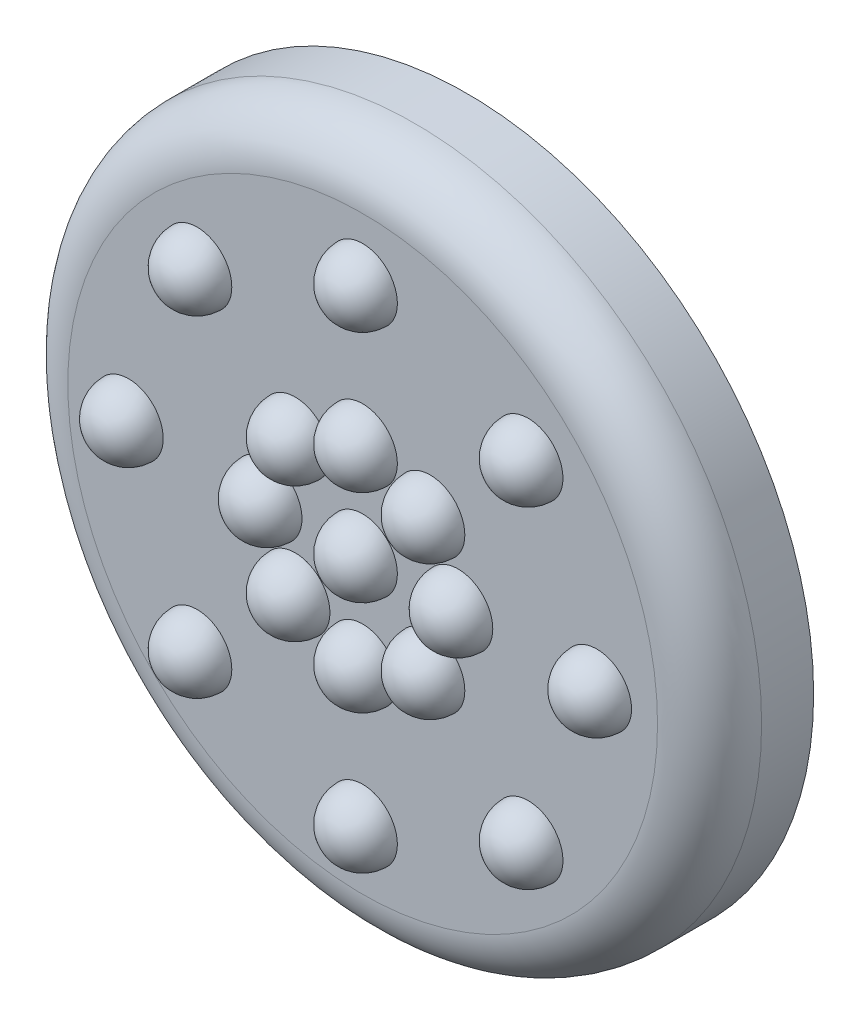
ISO-10303-21;
HEADER;
FILE_DESCRIPTION(('STEP AP214'),'2;1');
FILE_NAME('part.step','',(''),(''),'','','');
FILE_SCHEMA(('AUTOMOTIVE_DESIGN { 1 0 10303 214 1 1 1 1 }'));
ENDSEC;
DATA;
#1=APPLICATION_CONTEXT('core data for automotive mechanical design processes');
#2=APPLICATION_PROTOCOL_DEFINITION('international standard','automotive_design',2000,#1);
#3=PRODUCT_CONTEXT('',#1,'mechanical');
#4=PRODUCT('Part','Part','',(#3));
#5=PRODUCT_RELATED_PRODUCT_CATEGORY('part','',(#4));
#6=PRODUCT_DEFINITION_FORMATION('','',#4);
#7=PRODUCT_DEFINITION_CONTEXT('part definition',#1,'design');
#8=PRODUCT_DEFINITION('design','',#6,#7);
#9=PRODUCT_DEFINITION_SHAPE('','',#8);
#10=(LENGTH_UNIT() NAMED_UNIT(*) SI_UNIT(.MILLI.,.METRE.));
#11=(NAMED_UNIT(*) PLANE_ANGLE_UNIT() SI_UNIT($,.RADIAN.));
#12=(NAMED_UNIT(*) SI_UNIT($,.STERADIAN.) SOLID_ANGLE_UNIT());
#13=UNCERTAINTY_MEASURE_WITH_UNIT(LENGTH_MEASURE(1.E-05),#10,'distance_accuracy_value','');
#14=(GEOMETRIC_REPRESENTATION_CONTEXT(3) GLOBAL_UNCERTAINTY_ASSIGNED_CONTEXT((#13)) GLOBAL_UNIT_ASSIGNED_CONTEXT((#10,
#11,#12)) REPRESENTATION_CONTEXT('',''));
#15=CARTESIAN_POINT('',(0.,0.,0.));
#16=DIRECTION('',(0.,0.,1.));
#17=DIRECTION('',(1.,0.,0.));
#18=AXIS2_PLACEMENT_3D('',#15,#16,#17);
#19=CARTESIAN_POINT('',(0.,0.,30.));
#20=DIRECTION('',(0.,0.,-1.));
#21=DIRECTION('',(-1.,0.,0.));
#22=AXIS2_PLACEMENT_3D('',#19,#20,#21);
#23=CYLINDRICAL_SURFACE('',#22,100.);
#24=CARTESIAN_POINT('',(0.,0.,15.));
#25=DIRECTION('',(0.,0.,1.));
#26=DIRECTION('',(1.,0.,0.));
#27=AXIS2_PLACEMENT_3D('',#24,#25,#26);
#28=CIRCLE('',#27,100.);
#29=CARTESIAN_POINT('',(100.,0.,15.));
#30=VERTEX_POINT('',#29);
#31=EDGE_CURVE('E89',#30,#30,#28,.F.);
#32=ORIENTED_EDGE('',*,*,#31,.T.);
#33=EDGE_LOOP('',(#32));
#34=FACE_BOUND('',#33,.T.);
#35=CARTESIAN_POINT('',(0.,0.,0.));
#36=DIRECTION('',(0.,0.,1.));
#37=DIRECTION('',(1.,0.,0.));
#38=AXIS2_PLACEMENT_3D('',#35,#36,#37);
#39=CIRCLE('',#38,100.);
#40=CARTESIAN_POINT('',(100.,0.,0.));
#41=VERTEX_POINT('',#40);
#42=EDGE_CURVE('E95',#41,#41,#39,.T.);
#43=ORIENTED_EDGE('',*,*,#42,.T.);
#44=EDGE_LOOP('',(#43));
#45=FACE_BOUND('',#44,.T.);
#46=ADVANCED_FACE('F33',(#34,#45),#23,.T.);
#47=CARTESIAN_POINT('',(0.,0.,30.));
#48=DIRECTION('',(0.,0.,1.));
#49=DIRECTION('',(1.,0.,0.));
#50=AXIS2_PLACEMENT_3D('',#47,#48,#49);
#51=PLANE('',#50);
#52=CARTESIAN_POINT('',(0.,0.,30.));
#53=DIRECTION('',(0.,0.,1.));
#54=DIRECTION('',(1.,0.,0.));
#55=AXIS2_PLACEMENT_3D('',#52,#53,#54);
#56=CIRCLE('',#55,10.);
#57=CARTESIAN_POINT('',(10.,0.,30.));
#58=VERTEX_POINT('',#57);
#59=EDGE_CURVE('E37',#58,#58,#56,.F.);
#60=ORIENTED_EDGE('',*,*,#59,.T.);
#61=EDGE_LOOP('',(#60));
#62=FACE_BOUND('',#61,.T.);
#63=CARTESIAN_POINT('',(19.4454364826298,-19.4454364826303,30.));
#64=DIRECTION('',(0.,0.,1.));
#65=DIRECTION('',(1.,0.,0.));
#66=AXIS2_PLACEMENT_3D('',#63,#64,#65);
#67=CIRCLE('',#66,10.);
#68=CARTESIAN_POINT('',(29.4454364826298,-19.4454364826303,30.));
#69=VERTEX_POINT('',#68);
#70=EDGE_CURVE('E10',#69,#69,#67,.T.);
#71=ORIENTED_EDGE('',*,*,#70,.F.);
#72=EDGE_LOOP('',(#71));
#73=FACE_BOUND('',#72,.T.);
#74=CARTESIAN_POINT('',(27.5,-2.79780844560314E-13,30.));
#75=DIRECTION('',(0.,0.,1.));
#76=DIRECTION('',(1.,0.,0.));
#77=AXIS2_PLACEMENT_3D('',#74,#75,#76);
#78=CIRCLE('',#77,10.);
#79=CARTESIAN_POINT('',(37.5,-2.79780844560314E-13,30.));
#80=VERTEX_POINT('',#79);
#81=EDGE_CURVE('E41',#80,#80,#78,.T.);
#82=ORIENTED_EDGE('',*,*,#81,.F.);
#83=EDGE_LOOP('',(#82));
#84=FACE_BOUND('',#83,.T.);
#85=CARTESIAN_POINT('',(19.4454364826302,19.4454364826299,30.));
#86=DIRECTION('',(0.,0.,1.));
#87=DIRECTION('',(1.,0.,0.));
#88=AXIS2_PLACEMENT_3D('',#85,#86,#87);
#89=CIRCLE('',#88,10.);
#90=CARTESIAN_POINT('',(29.4454364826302,19.4454364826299,30.));
#91=VERTEX_POINT('',#90);
#92=EDGE_CURVE('E45',#91,#91,#89,.T.);
#93=ORIENTED_EDGE('',*,*,#92,.F.);
#94=EDGE_LOOP('',(#93));
#95=FACE_BOUND('',#94,.T.);
#96=CARTESIAN_POINT('',(0.,27.5,30.));
#97=DIRECTION('',(0.,0.,1.));
#98=DIRECTION('',(1.,0.,0.));
#99=AXIS2_PLACEMENT_3D('',#96,#97,#98);
#100=CIRCLE('',#99,10.);
#101=CARTESIAN_POINT('',(10.,27.5,30.));
#102=VERTEX_POINT('',#101);
#103=EDGE_CURVE('E50',#102,#102,#100,.T.);
#104=ORIENTED_EDGE('',*,*,#103,.F.);
#105=EDGE_LOOP('',(#104));
#106=FACE_BOUND('',#105,.T.);
#107=CARTESIAN_POINT('',(-19.44543648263,19.4454364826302,30.));
#108=DIRECTION('',(0.,0.,1.));
#109=DIRECTION('',(1.,0.,0.));
#110=AXIS2_PLACEMENT_3D('',#107,#108,#109);
#111=CIRCLE('',#110,10.);
#112=CARTESIAN_POINT('',(-9.44543648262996,19.4454364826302,30.));
#113=VERTEX_POINT('',#112);
#114=EDGE_CURVE('E53',#113,#113,#111,.T.);
#115=ORIENTED_EDGE('',*,*,#114,.F.);
#116=EDGE_LOOP('',(#115));
#117=FACE_BOUND('',#116,.T.);
#118=CARTESIAN_POINT('',(-27.5,0.,30.));
#119=DIRECTION('',(0.,0.,1.));
#120=DIRECTION('',(1.,0.,0.));
#121=AXIS2_PLACEMENT_3D('',#118,#119,#120);
#122=CIRCLE('',#121,10.);
#123=CARTESIAN_POINT('',(-17.5,0.,30.));
#124=VERTEX_POINT('',#123);
#125=EDGE_CURVE('E56',#124,#124,#122,.T.);
#126=ORIENTED_EDGE('',*,*,#125,.F.);
#127=EDGE_LOOP('',(#126));
#128=FACE_BOUND('',#127,.T.);
#129=CARTESIAN_POINT('',(-19.4454364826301,-19.44543648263,30.));
#130=DIRECTION('',(0.,0.,1.));
#131=DIRECTION('',(1.,0.,0.));
#132=AXIS2_PLACEMENT_3D('',#129,#130,#131);
#133=CIRCLE('',#132,10.);
#134=CARTESIAN_POINT('',(-9.44543648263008,-19.44543648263,30.));
#135=VERTEX_POINT('',#134);
#136=EDGE_CURVE('E59',#135,#135,#133,.T.);
#137=ORIENTED_EDGE('',*,*,#136,.F.);
#138=EDGE_LOOP('',(#137));
#139=FACE_BOUND('',#138,.T.);
#140=CARTESIAN_POINT('',(47.7297077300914,-47.7297077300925,30.));
#141=DIRECTION('',(0.,0.,1.));
#142=DIRECTION('',(1.,0.,0.));
#143=AXIS2_PLACEMENT_3D('',#140,#141,#142);
#144=CIRCLE('',#143,10.);
#145=CARTESIAN_POINT('',(57.7297077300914,-47.7297077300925,30.));
#146=VERTEX_POINT('',#145);
#147=EDGE_CURVE('E62',#146,#146,#144,.T.);
#148=ORIENTED_EDGE('',*,*,#147,.F.);
#149=EDGE_LOOP('',(#148));
#150=FACE_BOUND('',#149,.T.);
#151=CARTESIAN_POINT('',(67.5,-6.9875860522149E-13,30.));
#152=DIRECTION('',(0.,0.,1.));
#153=DIRECTION('',(1.,0.,0.));
#154=AXIS2_PLACEMENT_3D('',#151,#152,#153);
#155=CIRCLE('',#154,10.);
#156=CARTESIAN_POINT('',(77.5,-6.9875860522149E-13,30.));
#157=VERTEX_POINT('',#156);
#158=EDGE_CURVE('E65',#157,#157,#155,.T.);
#159=ORIENTED_EDGE('',*,*,#158,.F.);
#160=EDGE_LOOP('',(#159));
#161=FACE_BOUND('',#160,.T.);
#162=CARTESIAN_POINT('',(47.7297077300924,47.7297077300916,30.));
#163=DIRECTION('',(0.,0.,1.));
#164=DIRECTION('',(1.,0.,0.));
#165=AXIS2_PLACEMENT_3D('',#162,#163,#164);
#166=CIRCLE('',#165,10.);
#167=CARTESIAN_POINT('',(57.7297077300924,47.7297077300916,30.));
#168=VERTEX_POINT('',#167);
#169=EDGE_CURVE('E68',#168,#168,#166,.T.);
#170=ORIENTED_EDGE('',*,*,#169,.F.);
#171=EDGE_LOOP('',(#170));
#172=FACE_BOUND('',#171,.T.);
#173=CARTESIAN_POINT('',(0.,67.5,30.));
#174=DIRECTION('',(0.,0.,1.));
#175=DIRECTION('',(1.,0.,0.));
#176=AXIS2_PLACEMENT_3D('',#173,#174,#175);
#177=CIRCLE('',#176,10.);
#178=CARTESIAN_POINT('',(10.,67.5,30.));
#179=VERTEX_POINT('',#178);
#180=EDGE_CURVE('E71',#179,#179,#177,.T.);
#181=ORIENTED_EDGE('',*,*,#180,.F.);
#182=EDGE_LOOP('',(#181));
#183=FACE_BOUND('',#182,.T.);
#184=CARTESIAN_POINT('',(-47.7297077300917,47.7297077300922,30.));
#185=DIRECTION('',(0.,0.,1.));
#186=DIRECTION('',(1.,0.,0.));
#187=AXIS2_PLACEMENT_3D('',#184,#185,#186);
#188=CIRCLE('',#187,10.);
#189=CARTESIAN_POINT('',(-37.7297077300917,47.7297077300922,30.));
#190=VERTEX_POINT('',#189);
#191=EDGE_CURVE('E74',#190,#190,#188,.T.);
#192=ORIENTED_EDGE('',*,*,#191,.F.);
#193=EDGE_LOOP('',(#192));
#194=FACE_BOUND('',#193,.T.);
#195=CARTESIAN_POINT('',(-67.5,2.27408624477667E-13,30.));
#196=DIRECTION('',(0.,0.,1.));
#197=DIRECTION('',(1.,0.,0.));
#198=AXIS2_PLACEMENT_3D('',#195,#196,#197);
#199=CIRCLE('',#198,10.);
#200=CARTESIAN_POINT('',(-57.5,2.27408624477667E-13,30.));
#201=VERTEX_POINT('',#200);
#202=EDGE_CURVE('E77',#201,#201,#199,.T.);
#203=ORIENTED_EDGE('',*,*,#202,.F.);
#204=EDGE_LOOP('',(#203));
#205=FACE_BOUND('',#204,.T.);
#206=CARTESIAN_POINT('',(-47.729707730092,-47.7297077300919,30.));
#207=DIRECTION('',(0.,0.,1.));
#208=DIRECTION('',(1.,0.,0.));
#209=AXIS2_PLACEMENT_3D('',#206,#207,#208);
#210=CIRCLE('',#209,10.);
#211=CARTESIAN_POINT('',(-37.729707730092,-47.7297077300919,30.));
#212=VERTEX_POINT('',#211);
#213=EDGE_CURVE('E80',#212,#212,#210,.T.);
#214=ORIENTED_EDGE('',*,*,#213,.F.);
#215=EDGE_LOOP('',(#214));
#216=FACE_BOUND('',#215,.T.);
#217=CARTESIAN_POINT('',(0.,-27.5,30.));
#218=DIRECTION('',(0.,0.,1.));
#219=DIRECTION('',(1.,0.,0.));
#220=AXIS2_PLACEMENT_3D('',#217,#218,#219);
#221=CIRCLE('',#220,10.);
#222=CARTESIAN_POINT('',(10.,-27.5,30.));
#223=VERTEX_POINT('',#222);
#224=EDGE_CURVE('E83',#223,#223,#221,.T.);
#225=ORIENTED_EDGE('',*,*,#224,.F.);
#226=EDGE_LOOP('',(#225));
#227=FACE_BOUND('',#226,.T.);
#228=CARTESIAN_POINT('',(0.,-67.5,30.));
#229=DIRECTION('',(0.,0.,1.));
#230=DIRECTION('',(1.,0.,0.));
#231=AXIS2_PLACEMENT_3D('',#228,#229,#230);
#232=CIRCLE('',#231,10.);
#233=CARTESIAN_POINT('',(10.,-67.5,30.));
#234=VERTEX_POINT('',#233);
#235=EDGE_CURVE('E86',#234,#234,#232,.T.);
#236=ORIENTED_EDGE('',*,*,#235,.F.);
#237=EDGE_LOOP('',(#236));
#238=FACE_BOUND('',#237,.T.);
#239=CARTESIAN_POINT('',(0.,0.,30.));
#240=DIRECTION('',(0.,0.,1.));
#241=DIRECTION('',(1.,0.,0.));
#242=AXIS2_PLACEMENT_3D('',#239,#240,#241);
#243=CIRCLE('',#242,85.);
#244=CARTESIAN_POINT('',(85.,0.,30.));
#245=VERTEX_POINT('',#244);
#246=EDGE_CURVE('E92',#245,#245,#243,.T.);
#247=ORIENTED_EDGE('',*,*,#246,.T.);
#248=EDGE_LOOP('',(#247));
#249=FACE_BOUND('',#248,.T.);
#250=ADVANCED_FACE('F102',(#62,#73,#84,#95,#106,#117,#128,#139,#150,#161,#172,#183,#194,#205,
#216,#227,#238,#249),#51,.T.);
#251=CARTESIAN_POINT('',(0.,0.,0.));
#252=DIRECTION('',(0.,0.,1.));
#253=DIRECTION('',(1.,0.,0.));
#254=AXIS2_PLACEMENT_3D('',#251,#252,#253);
#255=PLANE('',#254);
#256=ORIENTED_EDGE('',*,*,#42,.F.);
#257=EDGE_LOOP('',(#256));
#258=FACE_BOUND('',#257,.T.);
#259=ADVANCED_FACE('F119',(#258),#255,.F.);
#260=CARTESIAN_POINT('',(0.,0.,15.));
#261=DIRECTION('',(0.,0.,1.));
#262=DIRECTION('',(1.,0.,0.));
#263=AXIS2_PLACEMENT_3D('',#260,#261,#262);
#264=TOROIDAL_SURFACE('',#263,85.,15.);
#265=ORIENTED_EDGE('',*,*,#31,.F.);
#266=EDGE_LOOP('',(#265));
#267=FACE_BOUND('',#266,.T.);
#268=ORIENTED_EDGE('',*,*,#246,.F.);
#269=EDGE_LOOP('',(#268));
#270=FACE_BOUND('',#269,.T.);
#271=ADVANCED_FACE('F35',(#267,#270),#264,.T.);
#272=CARTESIAN_POINT('',(0.,-67.5,30.));
#273=DIRECTION('',(-1.,0.,0.));
#274=DIRECTION('',(0.,1.,0.));
#275=AXIS2_PLACEMENT_3D('',#272,#273,#274);
#276=SPHERICAL_SURFACE('',#275,10.);
#277=CARTESIAN_POINT('',(0.,-67.5,30.));
#278=DIRECTION('',(0.,0.,1.));
#279=DIRECTION('',(1.,0.,0.));
#280=AXIS2_PLACEMENT_3D('',#277,#278,#279);
#281=SPHERICAL_SURFACE('',#280,10.);
#282=ORIENTED_EDGE('',*,*,#235,.T.);
#283=EDGE_LOOP('',(#282));
#284=FACE_BOUND('',#283,.T.);
#285=ADVANCED_FACE('F125',(#284),#281,.T.);
#286=CARTESIAN_POINT('',(0.,-27.5,30.));
#287=DIRECTION('',(-1.,0.,0.));
#288=DIRECTION('',(0.,1.,0.));
#289=AXIS2_PLACEMENT_3D('',#286,#287,#288);
#290=SPHERICAL_SURFACE('',#289,10.);
#291=CARTESIAN_POINT('',(0.,-27.5,30.));
#292=DIRECTION('',(0.,0.,1.));
#293=DIRECTION('',(1.,0.,0.));
#294=AXIS2_PLACEMENT_3D('',#291,#292,#293);
#295=SPHERICAL_SURFACE('',#294,10.);
#296=ORIENTED_EDGE('',*,*,#224,.T.);
#297=EDGE_LOOP('',(#296));
#298=FACE_BOUND('',#297,.T.);
#299=ADVANCED_FACE('F128',(#298),#295,.T.);
#300=CARTESIAN_POINT('',(-47.729707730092,-47.7297077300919,30.));
#301=DIRECTION('',(-0.707106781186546,0.707106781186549,0.));
#302=DIRECTION('',(0.707106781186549,0.707106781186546,0.));
#303=AXIS2_PLACEMENT_3D('',#300,#301,#302);
#304=SPHERICAL_SURFACE('',#303,10.);
#305=CARTESIAN_POINT('',(-47.729707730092,-47.7297077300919,30.));
#306=DIRECTION('',(0.,0.,1.));
#307=DIRECTION('',(1.,0.,0.));
#308=AXIS2_PLACEMENT_3D('',#305,#306,#307);
#309=SPHERICAL_SURFACE('',#308,10.);
#310=ORIENTED_EDGE('',*,*,#213,.T.);
#311=EDGE_LOOP('',(#310));
#312=FACE_BOUND('',#311,.T.);
#313=ADVANCED_FACE('F132',(#312),#309,.T.);
#314=CARTESIAN_POINT('',(-67.5,2.27408624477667E-13,30.));
#315=DIRECTION('',(0.,1.,0.));
#316=DIRECTION('',(1.,0.,0.));
#317=AXIS2_PLACEMENT_3D('',#314,#315,#316);
#318=SPHERICAL_SURFACE('',#317,10.);
#319=CARTESIAN_POINT('',(-67.5,2.27408624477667E-13,30.));
#320=DIRECTION('',(0.,0.,1.));
#321=DIRECTION('',(1.,0.,0.));
#322=AXIS2_PLACEMENT_3D('',#319,#320,#321);
#323=SPHERICAL_SURFACE('',#322,10.);
#324=ORIENTED_EDGE('',*,*,#202,.T.);
#325=EDGE_LOOP('',(#324));
#326=FACE_BOUND('',#325,.T.);
#327=ADVANCED_FACE('F136',(#326),#323,.T.);
#328=CARTESIAN_POINT('',(-47.7297077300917,47.7297077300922,30.));
#329=DIRECTION('',(0.707106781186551,0.707106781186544,0.));
#330=DIRECTION('',(0.707106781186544,-0.707106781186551,0.));
#331=AXIS2_PLACEMENT_3D('',#328,#329,#330);
#332=SPHERICAL_SURFACE('',#331,10.);
#333=CARTESIAN_POINT('',(-47.7297077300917,47.7297077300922,30.));
#334=DIRECTION('',(0.,0.,1.));
#335=DIRECTION('',(1.,0.,0.));
#336=AXIS2_PLACEMENT_3D('',#333,#334,#335);
#337=SPHERICAL_SURFACE('',#336,10.);
#338=ORIENTED_EDGE('',*,*,#191,.T.);
#339=EDGE_LOOP('',(#338));
#340=FACE_BOUND('',#339,.T.);
#341=ADVANCED_FACE('F140',(#340),#337,.T.);
#342=CARTESIAN_POINT('',(0.,67.5,30.));
#343=DIRECTION('',(1.,0.,0.));
#344=DIRECTION('',(0.,-1.,0.));
#345=AXIS2_PLACEMENT_3D('',#342,#343,#344);
#346=SPHERICAL_SURFACE('',#345,10.);
#347=CARTESIAN_POINT('',(0.,67.5,30.));
#348=DIRECTION('',(0.,0.,1.));
#349=DIRECTION('',(1.,0.,0.));
#350=AXIS2_PLACEMENT_3D('',#347,#348,#349);
#351=SPHERICAL_SURFACE('',#350,10.);
#352=ORIENTED_EDGE('',*,*,#180,.T.);
#353=EDGE_LOOP('',(#352));
#354=FACE_BOUND('',#353,.T.);
#355=ADVANCED_FACE('F144',(#354),#351,.T.);
#356=CARTESIAN_POINT('',(47.7297077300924,47.7297077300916,30.));
#357=DIRECTION('',(0.707106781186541,-0.707106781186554,0.));
#358=DIRECTION('',(-0.707106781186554,-0.707106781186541,0.));
#359=AXIS2_PLACEMENT_3D('',#356,#357,#358);
#360=SPHERICAL_SURFACE('',#359,10.);
#361=CARTESIAN_POINT('',(47.7297077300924,47.7297077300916,30.));
#362=DIRECTION('',(0.,0.,1.));
#363=DIRECTION('',(1.,0.,0.));
#364=AXIS2_PLACEMENT_3D('',#361,#362,#363);
#365=SPHERICAL_SURFACE('',#364,10.);
#366=ORIENTED_EDGE('',*,*,#169,.T.);
#367=EDGE_LOOP('',(#366));
#368=FACE_BOUND('',#367,.T.);
#369=ADVANCED_FACE('F148',(#368),#365,.T.);
#370=CARTESIAN_POINT('',(67.5,-6.9875860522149E-13,30.));
#371=DIRECTION('',(0.,-1.,0.));
#372=DIRECTION('',(-1.,0.,0.));
#373=AXIS2_PLACEMENT_3D('',#370,#371,#372);
#374=SPHERICAL_SURFACE('',#373,10.);
#375=CARTESIAN_POINT('',(67.5,-6.9875860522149E-13,30.));
#376=DIRECTION('',(0.,0.,1.));
#377=DIRECTION('',(1.,0.,0.));
#378=AXIS2_PLACEMENT_3D('',#375,#376,#377);
#379=SPHERICAL_SURFACE('',#378,10.);
#380=ORIENTED_EDGE('',*,*,#158,.T.);
#381=EDGE_LOOP('',(#380));
#382=FACE_BOUND('',#381,.T.);
#383=ADVANCED_FACE('F152',(#382),#379,.T.);
#384=CARTESIAN_POINT('',(47.7297077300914,-47.7297077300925,30.));
#385=DIRECTION('',(-0.707106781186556,-0.707106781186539,0.));
#386=DIRECTION('',(-0.707106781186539,0.707106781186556,0.));
#387=AXIS2_PLACEMENT_3D('',#384,#385,#386);
#388=SPHERICAL_SURFACE('',#387,10.);
#389=CARTESIAN_POINT('',(47.7297077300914,-47.7297077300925,30.));
#390=DIRECTION('',(0.,0.,1.));
#391=DIRECTION('',(1.,0.,0.));
#392=AXIS2_PLACEMENT_3D('',#389,#390,#391);
#393=SPHERICAL_SURFACE('',#392,10.);
#394=ORIENTED_EDGE('',*,*,#147,.T.);
#395=EDGE_LOOP('',(#394));
#396=FACE_BOUND('',#395,.T.);
#397=ADVANCED_FACE('F156',(#396),#393,.T.);
#398=CARTESIAN_POINT('',(-19.4454364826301,-19.44543648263,30.));
#399=DIRECTION('',(-0.707106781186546,0.707106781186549,0.));
#400=DIRECTION('',(0.707106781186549,0.707106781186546,0.));
#401=AXIS2_PLACEMENT_3D('',#398,#399,#400);
#402=SPHERICAL_SURFACE('',#401,10.);
#403=CARTESIAN_POINT('',(-19.4454364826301,-19.44543648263,30.));
#404=DIRECTION('',(0.,0.,1.));
#405=DIRECTION('',(1.,0.,0.));
#406=AXIS2_PLACEMENT_3D('',#403,#404,#405);
#407=SPHERICAL_SURFACE('',#406,10.);
#408=ORIENTED_EDGE('',*,*,#136,.T.);
#409=EDGE_LOOP('',(#408));
#410=FACE_BOUND('',#409,.T.);
#411=ADVANCED_FACE('F160',(#410),#407,.T.);
#412=CARTESIAN_POINT('',(-27.5,0.,30.));
#413=DIRECTION('',(0.,1.,0.));
#414=DIRECTION('',(1.,0.,0.));
#415=AXIS2_PLACEMENT_3D('',#412,#413,#414);
#416=SPHERICAL_SURFACE('',#415,10.);
#417=CARTESIAN_POINT('',(-27.5,0.,30.));
#418=DIRECTION('',(0.,0.,1.));
#419=DIRECTION('',(1.,0.,0.));
#420=AXIS2_PLACEMENT_3D('',#417,#418,#419);
#421=SPHERICAL_SURFACE('',#420,10.);
#422=ORIENTED_EDGE('',*,*,#125,.T.);
#423=EDGE_LOOP('',(#422));
#424=FACE_BOUND('',#423,.T.);
#425=ADVANCED_FACE('F164',(#424),#421,.T.);
#426=CARTESIAN_POINT('',(-19.44543648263,19.4454364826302,30.));
#427=DIRECTION('',(0.707106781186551,0.707106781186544,0.));
#428=DIRECTION('',(0.707106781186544,-0.707106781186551,0.));
#429=AXIS2_PLACEMENT_3D('',#426,#427,#428);
#430=SPHERICAL_SURFACE('',#429,10.);
#431=CARTESIAN_POINT('',(-19.44543648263,19.4454364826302,30.));
#432=DIRECTION('',(0.,0.,1.));
#433=DIRECTION('',(1.,0.,0.));
#434=AXIS2_PLACEMENT_3D('',#431,#432,#433);
#435=SPHERICAL_SURFACE('',#434,10.);
#436=ORIENTED_EDGE('',*,*,#114,.T.);
#437=EDGE_LOOP('',(#436));
#438=FACE_BOUND('',#437,.T.);
#439=ADVANCED_FACE('F168',(#438),#435,.T.);
#440=CARTESIAN_POINT('',(0.,27.5,30.));
#441=DIRECTION('',(1.,0.,0.));
#442=DIRECTION('',(0.,-1.,0.));
#443=AXIS2_PLACEMENT_3D('',#440,#441,#442);
#444=SPHERICAL_SURFACE('',#443,10.);
#445=CARTESIAN_POINT('',(0.,27.5,30.));
#446=DIRECTION('',(0.,0.,1.));
#447=DIRECTION('',(1.,0.,0.));
#448=AXIS2_PLACEMENT_3D('',#445,#446,#447);
#449=SPHERICAL_SURFACE('',#448,10.);
#450=ORIENTED_EDGE('',*,*,#103,.T.);
#451=EDGE_LOOP('',(#450));
#452=FACE_BOUND('',#451,.T.);
#453=ADVANCED_FACE('F172',(#452),#449,.T.);
#454=CARTESIAN_POINT('',(19.4454364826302,19.4454364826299,30.));
#455=DIRECTION('',(0.707106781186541,-0.707106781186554,0.));
#456=DIRECTION('',(-0.707106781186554,-0.707106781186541,0.));
#457=AXIS2_PLACEMENT_3D('',#454,#455,#456);
#458=SPHERICAL_SURFACE('',#457,10.);
#459=CARTESIAN_POINT('',(19.4454364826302,19.4454364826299,30.));
#460=DIRECTION('',(0.,0.,1.));
#461=DIRECTION('',(1.,0.,0.));
#462=AXIS2_PLACEMENT_3D('',#459,#460,#461);
#463=SPHERICAL_SURFACE('',#462,10.);
#464=ORIENTED_EDGE('',*,*,#92,.T.);
#465=EDGE_LOOP('',(#464));
#466=FACE_BOUND('',#465,.T.);
#467=ADVANCED_FACE('F176',(#466),#463,.T.);
#468=CARTESIAN_POINT('',(27.5,-2.79780844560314E-13,30.));
#469=DIRECTION('',(0.,-1.,0.));
#470=DIRECTION('',(-1.,0.,0.));
#471=AXIS2_PLACEMENT_3D('',#468,#469,#470);
#472=SPHERICAL_SURFACE('',#471,10.);
#473=CARTESIAN_POINT('',(27.5,-2.79780844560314E-13,30.));
#474=DIRECTION('',(0.,0.,1.));
#475=DIRECTION('',(1.,0.,0.));
#476=AXIS2_PLACEMENT_3D('',#473,#474,#475);
#477=SPHERICAL_SURFACE('',#476,10.);
#478=ORIENTED_EDGE('',*,*,#81,.T.);
#479=EDGE_LOOP('',(#478));
#480=FACE_BOUND('',#479,.T.);
#481=ADVANCED_FACE('F112',(#480),#477,.T.);
#482=CARTESIAN_POINT('',(19.4454364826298,-19.4454364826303,30.));
#483=DIRECTION('',(-0.707106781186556,-0.707106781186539,0.));
#484=DIRECTION('',(-0.707106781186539,0.707106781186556,0.));
#485=AXIS2_PLACEMENT_3D('',#482,#483,#484);
#486=SPHERICAL_SURFACE('',#485,10.);
#487=CARTESIAN_POINT('',(19.4454364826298,-19.4454364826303,30.));
#488=DIRECTION('',(0.,0.,1.));
#489=DIRECTION('',(1.,0.,0.));
#490=AXIS2_PLACEMENT_3D('',#487,#488,#489);
#491=SPHERICAL_SURFACE('',#490,10.);
#492=ORIENTED_EDGE('',*,*,#70,.T.);
#493=EDGE_LOOP('',(#492));
#494=FACE_BOUND('',#493,.T.);
#495=ADVANCED_FACE('F107',(#494),#491,.T.);
#496=CARTESIAN_POINT('',(0.,0.,30.));
#497=DIRECTION('',(1.,0.,0.));
#498=DIRECTION('',(0.,-1.,0.));
#499=AXIS2_PLACEMENT_3D('',#496,#497,#498);
#500=SPHERICAL_SURFACE('',#499,10.);
#501=CARTESIAN_POINT('',(0.,0.,30.));
#502=DIRECTION('',(0.,0.,1.));
#503=DIRECTION('',(1.,0.,0.));
#504=AXIS2_PLACEMENT_3D('',#501,#502,#503);
#505=SPHERICAL_SURFACE('',#504,10.);
#506=ORIENTED_EDGE('',*,*,#59,.F.);
#507=EDGE_LOOP('',(#506));
#508=FACE_BOUND('',#507,.T.);
#509=ADVANCED_FACE('F105',(#508),#505,.T.);
#510=CLOSED_SHELL('',(#46,#250,#259,#271,#285,#299,#313,#327,#341,#355,#369,#383,#397,#411,#425,
#439,#453,#467,#481,#495,#509));
#511=MANIFOLD_SOLID_BREP('B2',#510);
#512=ADVANCED_BREP_SHAPE_REPRESENTATION('',(#18,#511),#14);
#513=SHAPE_DEFINITION_REPRESENTATION(#9,#512);
ENDSEC;
END-ISO-10303-21;
